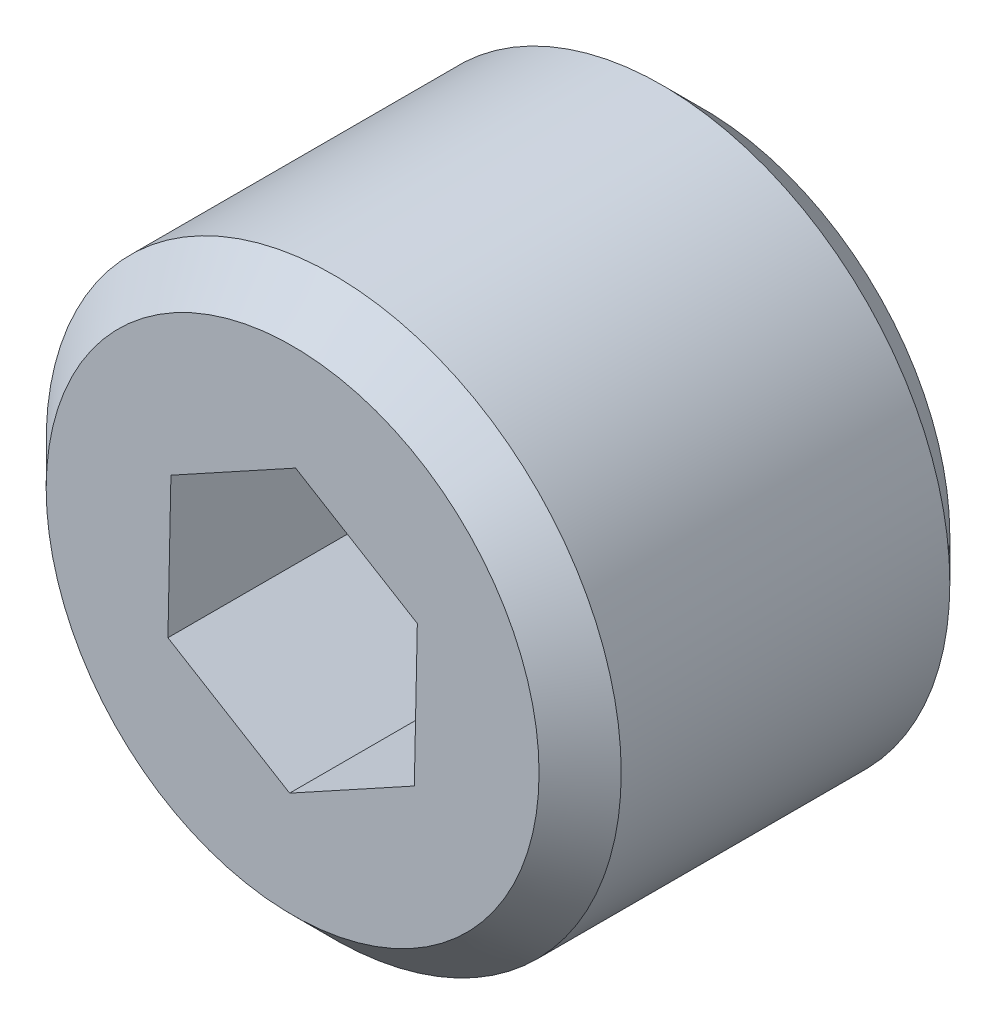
ISO-10303-21;
HEADER;
FILE_DESCRIPTION(('STEP AP214'),'2;1');
FILE_NAME('part.step','',(''),(''),'','','');
FILE_SCHEMA(('AUTOMOTIVE_DESIGN { 1 0 10303 214 1 1 1 1 }'));
ENDSEC;
DATA;
#1=APPLICATION_CONTEXT('core data for automotive mechanical design processes');
#2=APPLICATION_PROTOCOL_DEFINITION('international standard','automotive_design',2000,#1);
#3=PRODUCT_CONTEXT('',#1,'mechanical');
#4=PRODUCT('Part','Part','',(#3));
#5=PRODUCT_RELATED_PRODUCT_CATEGORY('part','',(#4));
#6=PRODUCT_DEFINITION_FORMATION('','',#4);
#7=PRODUCT_DEFINITION_CONTEXT('part definition',#1,'design');
#8=PRODUCT_DEFINITION('design','',#6,#7);
#9=PRODUCT_DEFINITION_SHAPE('','',#8);
#10=(LENGTH_UNIT() NAMED_UNIT(*) SI_UNIT(.MILLI.,.METRE.));
#11=(NAMED_UNIT(*) PLANE_ANGLE_UNIT() SI_UNIT($,.RADIAN.));
#12=(NAMED_UNIT(*) SI_UNIT($,.STERADIAN.) SOLID_ANGLE_UNIT());
#13=UNCERTAINTY_MEASURE_WITH_UNIT(LENGTH_MEASURE(1.E-05),#10,'distance_accuracy_value','');
#14=(GEOMETRIC_REPRESENTATION_CONTEXT(3) GLOBAL_UNCERTAINTY_ASSIGNED_CONTEXT((#13)) GLOBAL_UNIT_ASSIGNED_CONTEXT((#10,
#11,#12)) REPRESENTATION_CONTEXT('',''));
#15=CARTESIAN_POINT('',(0.,0.,0.));
#16=DIRECTION('',(0.,0.,1.));
#17=DIRECTION('',(1.,0.,0.));
#18=AXIS2_PLACEMENT_3D('',#15,#16,#17);
#19=CARTESIAN_POINT('',(0.,0.,10.));
#20=DIRECTION('',(0.,0.,-1.));
#21=DIRECTION('',(-1.,0.,0.));
#22=AXIS2_PLACEMENT_3D('',#19,#20,#21);
#23=CYLINDRICAL_SURFACE('',#22,7.);
#24=CARTESIAN_POINT('',(0.,0.,1.));
#25=DIRECTION('',(0.,0.,1.));
#26=DIRECTION('',(1.,0.,0.));
#27=AXIS2_PLACEMENT_3D('',#24,#25,#26);
#28=CIRCLE('',#27,7.);
#29=CARTESIAN_POINT('',(7.,0.,1.));
#30=VERTEX_POINT('',#29);
#31=EDGE_CURVE('E143',#30,#30,#28,.T.);
#32=ORIENTED_EDGE('',*,*,#31,.T.);
#33=EDGE_LOOP('',(#32));
#34=FACE_BOUND('',#33,.T.);
#35=CARTESIAN_POINT('',(0.,0.,9.));
#36=DIRECTION('',(0.,0.,1.));
#37=DIRECTION('',(1.,0.,0.));
#38=AXIS2_PLACEMENT_3D('',#35,#36,#37);
#39=CIRCLE('',#38,7.);
#40=CARTESIAN_POINT('',(7.,0.,9.));
#41=VERTEX_POINT('',#40);
#42=EDGE_CURVE('E135',#41,#41,#39,.F.);
#43=ORIENTED_EDGE('',*,*,#42,.T.);
#44=EDGE_LOOP('',(#43));
#45=FACE_BOUND('',#44,.T.);
#46=ADVANCED_FACE('F33',(#34,#45),#23,.T.);
#47=CARTESIAN_POINT('',(0.,0.,10.));
#48=DIRECTION('',(0.,0.,1.));
#49=DIRECTION('',(1.,0.,0.));
#50=AXIS2_PLACEMENT_3D('',#47,#48,#49);
#51=PLANE('',#50);
#52=CARTESIAN_POINT('',(0.,0.,10.));
#53=DIRECTION('',(0.,0.,1.));
#54=DIRECTION('',(1.,0.,0.));
#55=AXIS2_PLACEMENT_3D('',#52,#53,#54);
#56=CIRCLE('',#55,6.);
#57=CARTESIAN_POINT('',(6.,0.,10.));
#58=VERTEX_POINT('',#57);
#59=EDGE_CURVE('E11',#58,#58,#56,.T.);
#60=ORIENTED_EDGE('',*,*,#59,.T.);
#61=EDGE_LOOP('',(#60));
#62=FACE_BOUND('',#61,.T.);
#63=DIRECTION('',(-0.876389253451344,-0.481603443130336,0.));
#64=VECTOR('',#63,1.);
#65=CARTESIAN_POINT('',(0.073140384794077,3.46332939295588,10.));
#66=LINE('',#65,#64);
#67=CARTESIAN_POINT('',(0.073140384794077,3.46332939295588,10.));
#68=VERTEX_POINT('',#67);
#69=CARTESIAN_POINT('',(-2.9627610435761,1.79500612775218,10.));
#70=VERTEX_POINT('',#69);
#71=EDGE_CURVE('E48',#68,#70,#66,.T.);
#72=ORIENTED_EDGE('',*,*,#71,.F.);
#73=DIRECTION('',(-0.855275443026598,0.518173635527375,0.));
#74=VECTOR('',#73,1.);
#75=CARTESIAN_POINT('',(3.03590142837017,1.6683232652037,10.));
#76=LINE('',#75,#74);
#77=CARTESIAN_POINT('',(3.03590142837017,1.6683232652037,10.));
#78=VERTEX_POINT('',#77);
#79=EDGE_CURVE('E131',#78,#68,#76,.T.);
#80=ORIENTED_EDGE('',*,*,#79,.F.);
#81=DIRECTION('',(0.0211138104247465,0.999777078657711,0.));
#82=VECTOR('',#81,1.);
#83=CARTESIAN_POINT('',(2.9627610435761,-1.79500612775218,10.));
#84=LINE('',#83,#82);
#85=CARTESIAN_POINT('',(2.9627610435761,-1.79500612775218,10.));
#86=VERTEX_POINT('',#85);
#87=EDGE_CURVE('E129',#86,#78,#84,.T.);
#88=ORIENTED_EDGE('',*,*,#87,.F.);
#89=DIRECTION('',(0.876389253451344,0.481603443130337,0.));
#90=VECTOR('',#89,1.);
#91=CARTESIAN_POINT('',(-0.0731403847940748,-3.46332939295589,10.));
#92=LINE('',#91,#90);
#93=CARTESIAN_POINT('',(-0.0731403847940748,-3.46332939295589,10.));
#94=VERTEX_POINT('',#93);
#95=EDGE_CURVE('E96',#94,#86,#92,.T.);
#96=ORIENTED_EDGE('',*,*,#95,.F.);
#97=DIRECTION('',(0.855275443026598,-0.518173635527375,0.));
#98=VECTOR('',#97,1.);
#99=CARTESIAN_POINT('',(-3.03590142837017,-1.6683232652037,10.));
#100=LINE('',#99,#98);
#101=CARTESIAN_POINT('',(-3.03590142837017,-1.6683232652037,10.));
#102=VERTEX_POINT('',#101);
#103=EDGE_CURVE('E125',#102,#94,#100,.T.);
#104=ORIENTED_EDGE('',*,*,#103,.F.);
#105=DIRECTION('',(-0.0211138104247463,-0.999777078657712,0.));
#106=VECTOR('',#105,1.);
#107=CARTESIAN_POINT('',(-2.9627610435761,1.79500612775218,10.));
#108=LINE('',#107,#106);
#109=EDGE_CURVE('E122',#70,#102,#108,.T.);
#110=ORIENTED_EDGE('',*,*,#109,.F.);
#111=EDGE_LOOP('',(#72,#80,#88,#96,#104,#110));
#112=FACE_BOUND('',#111,.T.);
#113=ADVANCED_FACE('F157',(#62,#112),#51,.T.);
#114=CARTESIAN_POINT('',(0.,0.,0.));
#115=DIRECTION('',(0.,0.,1.));
#116=DIRECTION('',(1.,0.,0.));
#117=AXIS2_PLACEMENT_3D('',#114,#115,#116);
#118=PLANE('',#117);
#119=CARTESIAN_POINT('',(0.,0.,0.));
#120=DIRECTION('',(0.,0.,1.));
#121=DIRECTION('',(1.,0.,0.));
#122=AXIS2_PLACEMENT_3D('',#119,#120,#121);
#123=CIRCLE('',#122,5.99999999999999);
#124=CARTESIAN_POINT('',(5.99999999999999,0.,0.));
#125=VERTEX_POINT('',#124);
#126=EDGE_CURVE('E41',#125,#125,#123,.F.);
#127=ORIENTED_EDGE('',*,*,#126,.T.);
#128=EDGE_LOOP('',(#127));
#129=FACE_BOUND('',#128,.T.);
#130=ADVANCED_FACE('F148',(#129),#118,.F.);
#131=CARTESIAN_POINT('',(0.073140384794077,3.46332939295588,5.));
#132=DIRECTION('',(-0.481603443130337,0.876389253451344,0.));
#133=DIRECTION('',(-0.876389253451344,-0.481603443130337,0.));
#134=AXIS2_PLACEMENT_3D('',#131,#132,#133);
#135=PLANE('',#134);
#136=ORIENTED_EDGE('',*,*,#71,.T.);
#137=DIRECTION('',(0.,0.,1.));
#138=VECTOR('',#137,1.);
#139=CARTESIAN_POINT('',(-2.9627610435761,1.79500612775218,5.));
#140=LINE('',#139,#138);
#141=CARTESIAN_POINT('',(-2.9627610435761,1.79500612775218,5.));
#142=VERTEX_POINT('',#141);
#143=EDGE_CURVE('E78',#142,#70,#140,.T.);
#144=ORIENTED_EDGE('',*,*,#143,.F.);
#145=DIRECTION('',(-0.876389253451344,-0.481603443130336,0.));
#146=VECTOR('',#145,1.);
#147=CARTESIAN_POINT('',(0.073140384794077,3.46332939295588,5.));
#148=LINE('',#147,#146);
#149=CARTESIAN_POINT('',(0.073140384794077,3.46332939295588,5.));
#150=VERTEX_POINT('',#149);
#151=EDGE_CURVE('E133',#150,#142,#148,.T.);
#152=ORIENTED_EDGE('',*,*,#151,.F.);
#153=DIRECTION('',(0.,0.,1.));
#154=VECTOR('',#153,1.);
#155=CARTESIAN_POINT('',(0.073140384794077,3.46332939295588,5.));
#156=LINE('',#155,#154);
#157=EDGE_CURVE('E56',#150,#68,#156,.T.);
#158=ORIENTED_EDGE('',*,*,#157,.T.);
#159=EDGE_LOOP('',(#136,#144,#152,#158));
#160=FACE_BOUND('',#159,.T.);
#161=ADVANCED_FACE('F174',(#160),#135,.F.);
#162=CARTESIAN_POINT('',(3.03590142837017,1.6683232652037,5.));
#163=DIRECTION('',(0.518173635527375,0.855275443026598,0.));
#164=DIRECTION('',(-0.855275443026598,0.518173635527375,0.));
#165=AXIS2_PLACEMENT_3D('',#162,#163,#164);
#166=PLANE('',#165);
#167=ORIENTED_EDGE('',*,*,#79,.T.);
#168=ORIENTED_EDGE('',*,*,#157,.F.);
#169=DIRECTION('',(-0.855275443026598,0.518173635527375,0.));
#170=VECTOR('',#169,1.);
#171=CARTESIAN_POINT('',(3.03590142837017,1.6683232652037,5.));
#172=LINE('',#171,#170);
#173=CARTESIAN_POINT('',(3.03590142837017,1.6683232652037,5.));
#174=VERTEX_POINT('',#173);
#175=EDGE_CURVE('E108',#174,#150,#172,.T.);
#176=ORIENTED_EDGE('',*,*,#175,.F.);
#177=DIRECTION('',(0.,0.,1.));
#178=VECTOR('',#177,1.);
#179=CARTESIAN_POINT('',(3.03590142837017,1.6683232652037,5.));
#180=LINE('',#179,#178);
#181=EDGE_CURVE('E100',#174,#78,#180,.T.);
#182=ORIENTED_EDGE('',*,*,#181,.T.);
#183=EDGE_LOOP('',(#167,#168,#176,#182));
#184=FACE_BOUND('',#183,.T.);
#185=ADVANCED_FACE('F176',(#184),#166,.F.);
#186=CARTESIAN_POINT('',(2.9627610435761,-1.79500612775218,5.));
#187=DIRECTION('',(0.999777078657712,-0.0211138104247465,0.));
#188=DIRECTION('',(0.0211138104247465,0.999777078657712,0.));
#189=AXIS2_PLACEMENT_3D('',#186,#187,#188);
#190=PLANE('',#189);
#191=ORIENTED_EDGE('',*,*,#87,.T.);
#192=ORIENTED_EDGE('',*,*,#181,.F.);
#193=DIRECTION('',(0.0211138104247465,0.999777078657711,0.));
#194=VECTOR('',#193,1.);
#195=CARTESIAN_POINT('',(2.9627610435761,-1.79500612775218,5.));
#196=LINE('',#195,#194);
#197=CARTESIAN_POINT('',(2.9627610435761,-1.79500612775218,5.));
#198=VERTEX_POINT('',#197);
#199=EDGE_CURVE('E104',#198,#174,#196,.T.);
#200=ORIENTED_EDGE('',*,*,#199,.F.);
#201=DIRECTION('',(0.,0.,1.));
#202=VECTOR('',#201,1.);
#203=CARTESIAN_POINT('',(2.9627610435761,-1.79500612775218,5.));
#204=LINE('',#203,#202);
#205=EDGE_CURVE('E89',#198,#86,#204,.T.);
#206=ORIENTED_EDGE('',*,*,#205,.T.);
#207=EDGE_LOOP('',(#191,#192,#200,#206));
#208=FACE_BOUND('',#207,.T.);
#209=ADVANCED_FACE('F105',(#208),#190,.F.);
#210=CARTESIAN_POINT('',(-0.0731403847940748,-3.46332939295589,5.));
#211=DIRECTION('',(0.481603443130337,-0.876389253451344,0.));
#212=DIRECTION('',(0.876389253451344,0.481603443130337,0.));
#213=AXIS2_PLACEMENT_3D('',#210,#211,#212);
#214=PLANE('',#213);
#215=ORIENTED_EDGE('',*,*,#95,.T.);
#216=ORIENTED_EDGE('',*,*,#205,.F.);
#217=DIRECTION('',(0.876389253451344,0.481603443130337,0.));
#218=VECTOR('',#217,1.);
#219=CARTESIAN_POINT('',(-0.0731403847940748,-3.46332939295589,5.));
#220=LINE('',#219,#218);
#221=CARTESIAN_POINT('',(-0.0731403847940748,-3.46332939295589,5.));
#222=VERTEX_POINT('',#221);
#223=EDGE_CURVE('E93',#222,#198,#220,.T.);
#224=ORIENTED_EDGE('',*,*,#223,.F.);
#225=DIRECTION('',(0.,0.,1.));
#226=VECTOR('',#225,1.);
#227=CARTESIAN_POINT('',(-0.0731403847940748,-3.46332939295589,5.));
#228=LINE('',#227,#226);
#229=EDGE_CURVE('E101',#222,#94,#228,.T.);
#230=ORIENTED_EDGE('',*,*,#229,.T.);
#231=EDGE_LOOP('',(#215,#216,#224,#230));
#232=FACE_BOUND('',#231,.T.);
#233=ADVANCED_FACE('F91',(#232),#214,.F.);
#234=CARTESIAN_POINT('',(-3.03590142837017,-1.6683232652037,5.));
#235=DIRECTION('',(-0.518173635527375,-0.855275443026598,0.));
#236=DIRECTION('',(0.855275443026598,-0.518173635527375,0.));
#237=AXIS2_PLACEMENT_3D('',#234,#235,#236);
#238=PLANE('',#237);
#239=ORIENTED_EDGE('',*,*,#103,.T.);
#240=ORIENTED_EDGE('',*,*,#229,.F.);
#241=DIRECTION('',(0.855275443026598,-0.518173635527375,0.));
#242=VECTOR('',#241,1.);
#243=CARTESIAN_POINT('',(-3.03590142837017,-1.6683232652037,5.));
#244=LINE('',#243,#242);
#245=CARTESIAN_POINT('',(-3.03590142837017,-1.6683232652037,5.));
#246=VERTEX_POINT('',#245);
#247=EDGE_CURVE('E114',#246,#222,#244,.T.);
#248=ORIENTED_EDGE('',*,*,#247,.F.);
#249=DIRECTION('',(0.,0.,1.));
#250=VECTOR('',#249,1.);
#251=CARTESIAN_POINT('',(-3.03590142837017,-1.6683232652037,5.));
#252=LINE('',#251,#250);
#253=EDGE_CURVE('E138',#246,#102,#252,.T.);
#254=ORIENTED_EDGE('',*,*,#253,.T.);
#255=EDGE_LOOP('',(#239,#240,#248,#254));
#256=FACE_BOUND('',#255,.T.);
#257=ADVANCED_FACE('F187',(#256),#238,.F.);
#258=CARTESIAN_POINT('',(-2.9627610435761,1.79500612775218,5.));
#259=DIRECTION('',(-0.999777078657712,0.0211138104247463,0.));
#260=DIRECTION('',(-0.0211138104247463,-0.999777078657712,0.));
#261=AXIS2_PLACEMENT_3D('',#258,#259,#260);
#262=PLANE('',#261);
#263=ORIENTED_EDGE('',*,*,#109,.T.);
#264=ORIENTED_EDGE('',*,*,#253,.F.);
#265=DIRECTION('',(-0.0211138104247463,-0.999777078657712,0.));
#266=VECTOR('',#265,1.);
#267=CARTESIAN_POINT('',(-2.9627610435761,1.79500612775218,5.));
#268=LINE('',#267,#266);
#269=EDGE_CURVE('E116',#142,#246,#268,.T.);
#270=ORIENTED_EDGE('',*,*,#269,.F.);
#271=ORIENTED_EDGE('',*,*,#143,.T.);
#272=EDGE_LOOP('',(#263,#264,#270,#271));
#273=FACE_BOUND('',#272,.T.);
#274=ADVANCED_FACE('F172',(#273),#262,.F.);
#275=CARTESIAN_POINT('',(0.,0.,5.));
#276=DIRECTION('',(0.,0.,1.));
#277=DIRECTION('',(1.,0.,0.));
#278=AXIS2_PLACEMENT_3D('',#275,#276,#277);
#279=PLANE('',#278);
#280=ORIENTED_EDGE('',*,*,#151,.T.);
#281=ORIENTED_EDGE('',*,*,#269,.T.);
#282=ORIENTED_EDGE('',*,*,#247,.T.);
#283=ORIENTED_EDGE('',*,*,#223,.T.);
#284=ORIENTED_EDGE('',*,*,#199,.T.);
#285=ORIENTED_EDGE('',*,*,#175,.T.);
#286=EDGE_LOOP('',(#280,#281,#282,#283,#284,#285));
#287=FACE_BOUND('',#286,.T.);
#288=ADVANCED_FACE('F111',(#287),#279,.T.);
#289=CARTESIAN_POINT('',(0.,0.,1.));
#290=DIRECTION('',(0.,0.,1.));
#291=DIRECTION('',(1.,0.,0.));
#292=AXIS2_PLACEMENT_3D('',#289,#290,#291);
#293=CONICAL_SURFACE('',#292,7.,0.785398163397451);
#294=ORIENTED_EDGE('',*,*,#126,.F.);
#295=EDGE_LOOP('',(#294));
#296=FACE_BOUND('',#295,.T.);
#297=ORIENTED_EDGE('',*,*,#31,.F.);
#298=EDGE_LOOP('',(#297));
#299=FACE_BOUND('',#298,.T.);
#300=ADVANCED_FACE('F150',(#296,#299),#293,.T.);
#301=CARTESIAN_POINT('',(0.,0.,10.));
#302=DIRECTION('',(0.,0.,-1.));
#303=DIRECTION('',(-1.,0.,0.));
#304=AXIS2_PLACEMENT_3D('',#301,#302,#303);
#305=CONICAL_SURFACE('',#304,6.,0.785398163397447);
#306=ORIENTED_EDGE('',*,*,#42,.F.);
#307=EDGE_LOOP('',(#306));
#308=FACE_BOUND('',#307,.T.);
#309=ORIENTED_EDGE('',*,*,#59,.F.);
#310=EDGE_LOOP('',(#309));
#311=FACE_BOUND('',#310,.T.);
#312=ADVANCED_FACE('F35',(#308,#311),#305,.T.);
#313=CLOSED_SHELL('',(#46,#113,#130,#161,#185,#209,#233,#257,#274,#288,#300,#312));
#314=MANIFOLD_SOLID_BREP('B2',#313);
#315=ADVANCED_BREP_SHAPE_REPRESENTATION('',(#18,#314),#14);
#316=SHAPE_DEFINITION_REPRESENTATION(#9,#315);
ENDSEC;
END-ISO-10303-21;
